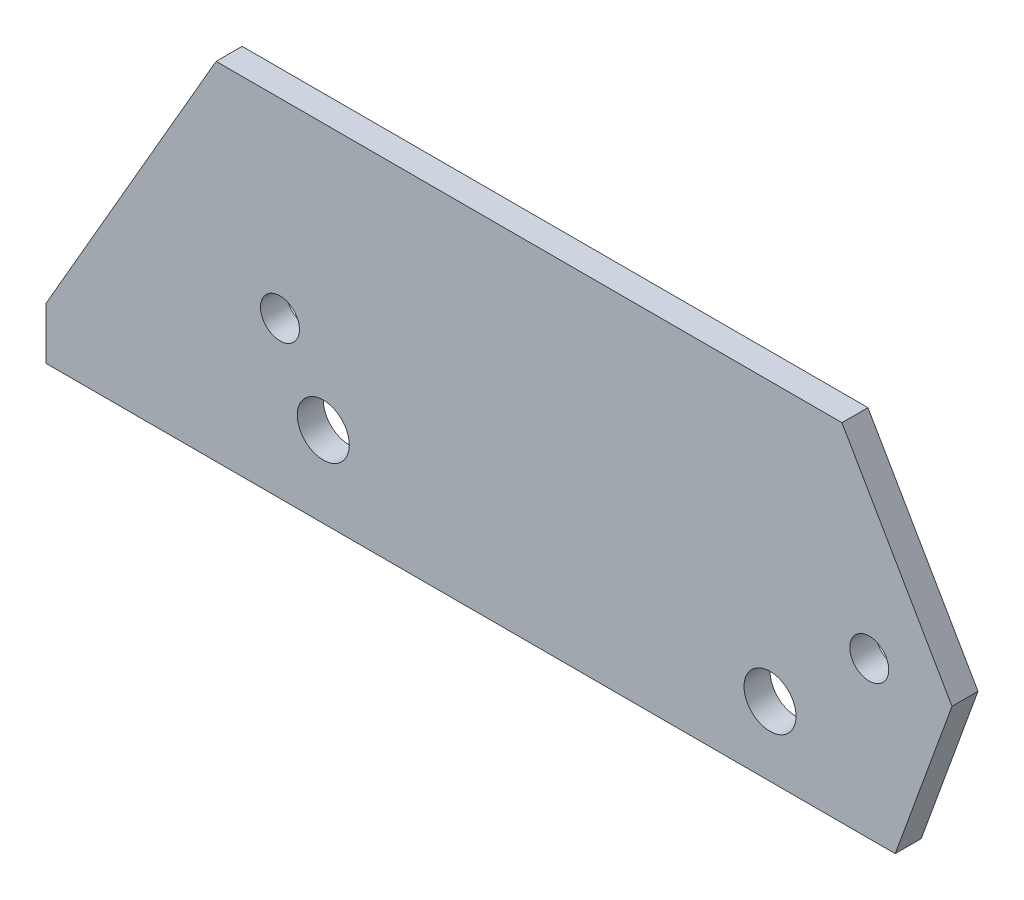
ISO-10303-21;
HEADER;
FILE_DESCRIPTION(('STEP AP214'),'2;1');
FILE_NAME('part.step','',(''),(''),'','','');
FILE_SCHEMA(('AUTOMOTIVE_DESIGN { 1 0 10303 214 1 1 1 1 }'));
ENDSEC;
DATA;
#1=APPLICATION_CONTEXT('core data for automotive mechanical design processes');
#2=APPLICATION_PROTOCOL_DEFINITION('international standard','automotive_design',2000,#1);
#3=PRODUCT_CONTEXT('',#1,'mechanical');
#4=PRODUCT('Part','Part','',(#3));
#5=PRODUCT_RELATED_PRODUCT_CATEGORY('part','',(#4));
#6=PRODUCT_DEFINITION_FORMATION('','',#4);
#7=PRODUCT_DEFINITION_CONTEXT('part definition',#1,'design');
#8=PRODUCT_DEFINITION('design','',#6,#7);
#9=PRODUCT_DEFINITION_SHAPE('','',#8);
#10=(LENGTH_UNIT() NAMED_UNIT(*) SI_UNIT(.MILLI.,.METRE.));
#11=(NAMED_UNIT(*) PLANE_ANGLE_UNIT() SI_UNIT($,.RADIAN.));
#12=(NAMED_UNIT(*) SI_UNIT($,.STERADIAN.) SOLID_ANGLE_UNIT());
#13=UNCERTAINTY_MEASURE_WITH_UNIT(LENGTH_MEASURE(1.E-05),#10,'distance_accuracy_value','');
#14=(GEOMETRIC_REPRESENTATION_CONTEXT(3) GLOBAL_UNCERTAINTY_ASSIGNED_CONTEXT((#13)) GLOBAL_UNIT_ASSIGNED_CONTEXT((#10,
#11,#12)) REPRESENTATION_CONTEXT('',''));
#15=CARTESIAN_POINT('',(0.,0.,0.));
#16=DIRECTION('',(0.,0.,1.));
#17=DIRECTION('',(1.,0.,0.));
#18=AXIS2_PLACEMENT_3D('',#15,#16,#17);
#19=CARTESIAN_POINT('',(0.,0.,3.));
#20=DIRECTION('',(0.,0.,-1.));
#21=DIRECTION('',(-1.,0.,0.));
#22=AXIS2_PLACEMENT_3D('',#19,#20,#21);
#23=PLANE('',#22);
#24=CARTESIAN_POINT('',(95.,18.,3.));
#25=DIRECTION('',(0.,0.,1.));
#26=DIRECTION('',(1.,0.,0.));
#27=AXIS2_PLACEMENT_3D('',#24,#25,#26);
#28=CIRCLE('',#27,2.25);
#29=CARTESIAN_POINT('',(97.25,18.,3.));
#30=VERTEX_POINT('',#29);
#31=EDGE_CURVE('E198',#30,#30,#28,.T.);
#32=ORIENTED_EDGE('',*,*,#31,.F.);
#33=EDGE_LOOP('',(#32));
#34=FACE_BOUND('',#33,.T.);
#35=CARTESIAN_POINT('',(27.,18.,3.));
#36=DIRECTION('',(0.,0.,1.));
#37=DIRECTION('',(1.,0.,0.));
#38=AXIS2_PLACEMENT_3D('',#35,#36,#37);
#39=CIRCLE('',#38,2.25);
#40=CARTESIAN_POINT('',(29.25,18.,3.));
#41=VERTEX_POINT('',#40);
#42=EDGE_CURVE('E130',#41,#41,#39,.T.);
#43=ORIENTED_EDGE('',*,*,#42,.F.);
#44=EDGE_LOOP('',(#43));
#45=FACE_BOUND('',#44,.T.);
#46=DIRECTION('',(1.,0.,0.));
#47=VECTOR('',#46,1.);
#48=CARTESIAN_POINT('',(98.,0.,3.));
#49=LINE('',#48,#47);
#50=CARTESIAN_POINT('',(0.,0.,3.));
#51=VERTEX_POINT('',#50);
#52=CARTESIAN_POINT('',(98.,0.,3.));
#53=VERTEX_POINT('',#52);
#54=EDGE_CURVE('E137',#51,#53,#49,.T.);
#55=ORIENTED_EDGE('',*,*,#54,.T.);
#56=DIRECTION('',(0.342020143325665,0.93969262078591,0.));
#57=VECTOR('',#56,1.);
#58=CARTESIAN_POINT('',(104.551464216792,18.,3.));
#59=LINE('',#58,#57);
#60=CARTESIAN_POINT('',(104.551464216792,18.,3.));
#61=VERTEX_POINT('',#60);
#62=EDGE_CURVE('E95',#53,#61,#59,.T.);
#63=ORIENTED_EDGE('',*,*,#62,.T.);
#64=DIRECTION('',(-0.499999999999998,0.86602540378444,0.));
#65=VECTOR('',#64,1.);
#66=CARTESIAN_POINT('',(91.8497582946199,40.,3.));
#67=LINE('',#66,#65);
#68=CARTESIAN_POINT('',(91.8497582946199,40.,3.));
#69=VERTEX_POINT('',#68);
#70=EDGE_CURVE('E108',#61,#69,#67,.T.);
#71=ORIENTED_EDGE('',*,*,#70,.T.);
#72=DIRECTION('',(-1.,0.,0.));
#73=VECTOR('',#72,1.);
#74=CARTESIAN_POINT('',(19.6299091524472,40.,3.));
#75=LINE('',#74,#73);
#76=CARTESIAN_POINT('',(19.6299091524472,40.,3.));
#77=VERTEX_POINT('',#76);
#78=EDGE_CURVE('E102',#69,#77,#75,.T.);
#79=ORIENTED_EDGE('',*,*,#78,.T.);
#80=DIRECTION('',(-0.499999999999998,-0.86602540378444,0.));
#81=VECTOR('',#80,1.);
#82=CARTESIAN_POINT('',(0.,6.,3.));
#83=LINE('',#82,#81);
#84=CARTESIAN_POINT('',(0.,6.,3.));
#85=VERTEX_POINT('',#84);
#86=EDGE_CURVE('E106',#77,#85,#83,.T.);
#87=ORIENTED_EDGE('',*,*,#86,.T.);
#88=DIRECTION('',(0.,-1.,0.));
#89=VECTOR('',#88,1.);
#90=CARTESIAN_POINT('',(0.,0.,3.));
#91=LINE('',#90,#89);
#92=EDGE_CURVE('E58',#85,#51,#91,.T.);
#93=ORIENTED_EDGE('',*,*,#92,.T.);
#94=EDGE_LOOP('',(#55,#63,#71,#79,#87,#93));
#95=FACE_BOUND('',#94,.T.);
#96=CARTESIAN_POINT('',(32.,9.33974596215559,3.));
#97=DIRECTION('',(0.,0.,1.));
#98=DIRECTION('',(1.,0.,0.));
#99=AXIS2_PLACEMENT_3D('',#96,#97,#98);
#100=CIRCLE('',#99,3.);
#101=CARTESIAN_POINT('',(35.,9.33974596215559,3.));
#102=VERTEX_POINT('',#101);
#103=EDGE_CURVE('E204',#102,#102,#100,.T.);
#104=ORIENTED_EDGE('',*,*,#103,.F.);
#105=EDGE_LOOP('',(#104));
#106=FACE_BOUND('',#105,.T.);
#107=CARTESIAN_POINT('',(83.5514642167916,8.,3.));
#108=DIRECTION('',(0.,0.,1.));
#109=DIRECTION('',(1.,0.,0.));
#110=AXIS2_PLACEMENT_3D('',#107,#108,#109);
#111=CIRCLE('',#110,3.00000000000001);
#112=CARTESIAN_POINT('',(86.5514642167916,8.,3.));
#113=VERTEX_POINT('',#112);
#114=EDGE_CURVE('E189',#113,#113,#111,.T.);
#115=ORIENTED_EDGE('',*,*,#114,.F.);
#116=EDGE_LOOP('',(#115));
#117=FACE_BOUND('',#116,.T.);
#118=ADVANCED_FACE('F41',(#34,#45,#95,#106,#117),#23,.F.);
#119=CARTESIAN_POINT('',(0.,0.,0.));
#120=DIRECTION('',(0.,0.,-1.));
#121=DIRECTION('',(-1.,0.,0.));
#122=AXIS2_PLACEMENT_3D('',#119,#120,#121);
#123=PLANE('',#122);
#124=CARTESIAN_POINT('',(95.,18.,0.));
#125=DIRECTION('',(0.,0.,1.));
#126=DIRECTION('',(1.,0.,0.));
#127=AXIS2_PLACEMENT_3D('',#124,#125,#126);
#128=CIRCLE('',#127,2.25);
#129=CARTESIAN_POINT('',(97.25,18.,0.));
#130=VERTEX_POINT('',#129);
#131=EDGE_CURVE('E195',#130,#130,#128,.T.);
#132=ORIENTED_EDGE('',*,*,#131,.T.);
#133=EDGE_LOOP('',(#132));
#134=FACE_BOUND('',#133,.T.);
#135=CARTESIAN_POINT('',(27.,18.,0.));
#136=DIRECTION('',(0.,0.,1.));
#137=DIRECTION('',(1.,0.,0.));
#138=AXIS2_PLACEMENT_3D('',#135,#136,#137);
#139=CIRCLE('',#138,2.25);
#140=CARTESIAN_POINT('',(29.25,18.,0.));
#141=VERTEX_POINT('',#140);
#142=EDGE_CURVE('E207',#141,#141,#139,.T.);
#143=ORIENTED_EDGE('',*,*,#142,.T.);
#144=EDGE_LOOP('',(#143));
#145=FACE_BOUND('',#144,.T.);
#146=DIRECTION('',(1.,0.,0.));
#147=VECTOR('',#146,1.);
#148=CARTESIAN_POINT('',(98.,0.,0.));
#149=LINE('',#148,#147);
#150=CARTESIAN_POINT('',(0.,0.,0.));
#151=VERTEX_POINT('',#150);
#152=CARTESIAN_POINT('',(98.,0.,0.));
#153=VERTEX_POINT('',#152);
#154=EDGE_CURVE('E126',#151,#153,#149,.T.);
#155=ORIENTED_EDGE('',*,*,#154,.F.);
#156=DIRECTION('',(0.,-1.,0.));
#157=VECTOR('',#156,1.);
#158=CARTESIAN_POINT('',(0.,0.,0.));
#159=LINE('',#158,#157);
#160=CARTESIAN_POINT('',(0.,6.,0.));
#161=VERTEX_POINT('',#160);
#162=EDGE_CURVE('E87',#161,#151,#159,.T.);
#163=ORIENTED_EDGE('',*,*,#162,.F.);
#164=DIRECTION('',(-0.499999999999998,-0.86602540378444,0.));
#165=VECTOR('',#164,1.);
#166=CARTESIAN_POINT('',(0.,6.,0.));
#167=LINE('',#166,#165);
#168=CARTESIAN_POINT('',(19.6299091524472,40.,0.));
#169=VERTEX_POINT('',#168);
#170=EDGE_CURVE('E81',#169,#161,#167,.T.);
#171=ORIENTED_EDGE('',*,*,#170,.F.);
#172=DIRECTION('',(-1.,0.,0.));
#173=VECTOR('',#172,1.);
#174=CARTESIAN_POINT('',(19.6299091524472,40.,0.));
#175=LINE('',#174,#173);
#176=CARTESIAN_POINT('',(91.8497582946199,40.,0.));
#177=VERTEX_POINT('',#176);
#178=EDGE_CURVE('E116',#177,#169,#175,.T.);
#179=ORIENTED_EDGE('',*,*,#178,.F.);
#180=DIRECTION('',(-0.499999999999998,0.86602540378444,0.));
#181=VECTOR('',#180,1.);
#182=CARTESIAN_POINT('',(91.8497582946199,40.,0.));
#183=LINE('',#182,#181);
#184=CARTESIAN_POINT('',(104.551464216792,18.,0.));
#185=VERTEX_POINT('',#184);
#186=EDGE_CURVE('E132',#185,#177,#183,.T.);
#187=ORIENTED_EDGE('',*,*,#186,.F.);
#188=DIRECTION('',(0.342020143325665,0.93969262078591,0.));
#189=VECTOR('',#188,1.);
#190=CARTESIAN_POINT('',(104.551464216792,18.,0.));
#191=LINE('',#190,#189);
#192=EDGE_CURVE('E129',#153,#185,#191,.T.);
#193=ORIENTED_EDGE('',*,*,#192,.F.);
#194=EDGE_LOOP('',(#155,#163,#171,#179,#187,#193));
#195=FACE_BOUND('',#194,.T.);
#196=CARTESIAN_POINT('',(32.,9.33974596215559,0.));
#197=DIRECTION('',(0.,0.,1.));
#198=DIRECTION('',(1.,0.,0.));
#199=AXIS2_PLACEMENT_3D('',#196,#197,#198);
#200=CIRCLE('',#199,3.);
#201=CARTESIAN_POINT('',(35.,9.33974596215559,0.));
#202=VERTEX_POINT('',#201);
#203=EDGE_CURVE('E201',#202,#202,#200,.T.);
#204=ORIENTED_EDGE('',*,*,#203,.T.);
#205=EDGE_LOOP('',(#204));
#206=FACE_BOUND('',#205,.T.);
#207=CARTESIAN_POINT('',(83.5514642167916,8.,0.));
#208=DIRECTION('',(0.,0.,1.));
#209=DIRECTION('',(1.,0.,0.));
#210=AXIS2_PLACEMENT_3D('',#207,#208,#209);
#211=CIRCLE('',#210,3.00000000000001);
#212=CARTESIAN_POINT('',(86.5514642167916,8.,0.));
#213=VERTEX_POINT('',#212);
#214=EDGE_CURVE('E192',#213,#213,#211,.T.);
#215=ORIENTED_EDGE('',*,*,#214,.T.);
#216=EDGE_LOOP('',(#215));
#217=FACE_BOUND('',#216,.T.);
#218=ADVANCED_FACE('F146',(#134,#145,#195,#206,#217),#123,.T.);
#219=CARTESIAN_POINT('',(98.,0.,3.));
#220=DIRECTION('',(0.,1.,0.));
#221=DIRECTION('',(-1.,0.,0.));
#222=AXIS2_PLACEMENT_3D('',#219,#220,#221);
#223=PLANE('',#222);
#224=ORIENTED_EDGE('',*,*,#154,.T.);
#225=DIRECTION('',(0.,0.,-1.));
#226=VECTOR('',#225,1.);
#227=CARTESIAN_POINT('',(98.,0.,3.));
#228=LINE('',#227,#226);
#229=EDGE_CURVE('E13',#53,#153,#228,.T.);
#230=ORIENTED_EDGE('',*,*,#229,.F.);
#231=ORIENTED_EDGE('',*,*,#54,.F.);
#232=DIRECTION('',(0.,0.,-1.));
#233=VECTOR('',#232,1.);
#234=CARTESIAN_POINT('',(0.,0.,3.));
#235=LINE('',#234,#233);
#236=EDGE_CURVE('E122',#51,#151,#235,.T.);
#237=ORIENTED_EDGE('',*,*,#236,.T.);
#238=EDGE_LOOP('',(#224,#230,#231,#237));
#239=FACE_BOUND('',#238,.T.);
#240=ADVANCED_FACE('F43',(#239),#223,.F.);
#241=CARTESIAN_POINT('',(104.551464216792,18.,3.));
#242=DIRECTION('',(-0.93969262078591,0.342020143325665,0.));
#243=DIRECTION('',(-0.342020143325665,-0.93969262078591,0.));
#244=AXIS2_PLACEMENT_3D('',#241,#242,#243);
#245=PLANE('',#244);
#246=ORIENTED_EDGE('',*,*,#192,.T.);
#247=DIRECTION('',(0.,0.,-1.));
#248=VECTOR('',#247,1.);
#249=CARTESIAN_POINT('',(104.551464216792,18.,3.));
#250=LINE('',#249,#248);
#251=EDGE_CURVE('E50',#61,#185,#250,.T.);
#252=ORIENTED_EDGE('',*,*,#251,.F.);
#253=ORIENTED_EDGE('',*,*,#62,.F.);
#254=ORIENTED_EDGE('',*,*,#229,.T.);
#255=EDGE_LOOP('',(#246,#252,#253,#254));
#256=FACE_BOUND('',#255,.T.);
#257=ADVANCED_FACE('F264',(#256),#245,.F.);
#258=CARTESIAN_POINT('',(91.8497582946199,40.,3.));
#259=DIRECTION('',(-0.86602540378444,-0.499999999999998,0.));
#260=DIRECTION('',(0.499999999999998,-0.86602540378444,0.));
#261=AXIS2_PLACEMENT_3D('',#258,#259,#260);
#262=PLANE('',#261);
#263=ORIENTED_EDGE('',*,*,#186,.T.);
#264=DIRECTION('',(0.,0.,-1.));
#265=VECTOR('',#264,1.);
#266=CARTESIAN_POINT('',(91.8497582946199,40.,3.));
#267=LINE('',#266,#265);
#268=EDGE_CURVE('E117',#69,#177,#267,.T.);
#269=ORIENTED_EDGE('',*,*,#268,.F.);
#270=ORIENTED_EDGE('',*,*,#70,.F.);
#271=ORIENTED_EDGE('',*,*,#251,.T.);
#272=EDGE_LOOP('',(#263,#269,#270,#271));
#273=FACE_BOUND('',#272,.T.);
#274=ADVANCED_FACE('F143',(#273),#262,.F.);
#275=CARTESIAN_POINT('',(19.6299091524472,40.,3.));
#276=DIRECTION('',(0.,-1.,0.));
#277=DIRECTION('',(0.,0.,-1.));
#278=AXIS2_PLACEMENT_3D('',#275,#276,#277);
#279=PLANE('',#278);
#280=ORIENTED_EDGE('',*,*,#178,.T.);
#281=DIRECTION('',(0.,0.,-1.));
#282=VECTOR('',#281,1.);
#283=CARTESIAN_POINT('',(19.6299091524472,40.,3.));
#284=LINE('',#283,#282);
#285=EDGE_CURVE('E113',#77,#169,#284,.T.);
#286=ORIENTED_EDGE('',*,*,#285,.F.);
#287=ORIENTED_EDGE('',*,*,#78,.F.);
#288=ORIENTED_EDGE('',*,*,#268,.T.);
#289=EDGE_LOOP('',(#280,#286,#287,#288));
#290=FACE_BOUND('',#289,.T.);
#291=ADVANCED_FACE('F114',(#290),#279,.F.);
#292=CARTESIAN_POINT('',(0.,6.,3.));
#293=DIRECTION('',(0.86602540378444,-0.499999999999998,0.));
#294=DIRECTION('',(0.499999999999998,0.86602540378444,0.));
#295=AXIS2_PLACEMENT_3D('',#292,#293,#294);
#296=PLANE('',#295);
#297=ORIENTED_EDGE('',*,*,#170,.T.);
#298=DIRECTION('',(0.,0.,-1.));
#299=VECTOR('',#298,1.);
#300=CARTESIAN_POINT('',(0.,6.,3.));
#301=LINE('',#300,#299);
#302=EDGE_CURVE('E118',#85,#161,#301,.T.);
#303=ORIENTED_EDGE('',*,*,#302,.F.);
#304=ORIENTED_EDGE('',*,*,#86,.F.);
#305=ORIENTED_EDGE('',*,*,#285,.T.);
#306=EDGE_LOOP('',(#297,#303,#304,#305));
#307=FACE_BOUND('',#306,.T.);
#308=ADVANCED_FACE('F120',(#307),#296,.F.);
#309=CARTESIAN_POINT('',(0.,0.,3.));
#310=DIRECTION('',(1.,0.,0.));
#311=DIRECTION('',(0.,0.,-1.));
#312=AXIS2_PLACEMENT_3D('',#309,#310,#311);
#313=PLANE('',#312);
#314=ORIENTED_EDGE('',*,*,#162,.T.);
#315=ORIENTED_EDGE('',*,*,#236,.F.);
#316=ORIENTED_EDGE('',*,*,#92,.F.);
#317=ORIENTED_EDGE('',*,*,#302,.T.);
#318=EDGE_LOOP('',(#314,#315,#316,#317));
#319=FACE_BOUND('',#318,.T.);
#320=ADVANCED_FACE('F151',(#319),#313,.F.);
#321=CARTESIAN_POINT('',(27.,18.,3.));
#322=DIRECTION('',(0.,0.,-1.));
#323=DIRECTION('',(-1.,0.,0.));
#324=AXIS2_PLACEMENT_3D('',#321,#322,#323);
#325=CYLINDRICAL_SURFACE('',#324,2.25);
#326=ORIENTED_EDGE('',*,*,#42,.T.);
#327=EDGE_LOOP('',(#326));
#328=FACE_BOUND('',#327,.T.);
#329=ORIENTED_EDGE('',*,*,#142,.F.);
#330=EDGE_LOOP('',(#329));
#331=FACE_BOUND('',#330,.T.);
#332=ADVANCED_FACE('F153',(#328,#331),#325,.F.);
#333=CARTESIAN_POINT('',(32.,9.33974596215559,3.));
#334=DIRECTION('',(0.,0.,-1.));
#335=DIRECTION('',(-1.,0.,0.));
#336=AXIS2_PLACEMENT_3D('',#333,#334,#335);
#337=CYLINDRICAL_SURFACE('',#336,3.);
#338=ORIENTED_EDGE('',*,*,#103,.T.);
#339=EDGE_LOOP('',(#338));
#340=FACE_BOUND('',#339,.T.);
#341=ORIENTED_EDGE('',*,*,#203,.F.);
#342=EDGE_LOOP('',(#341));
#343=FACE_BOUND('',#342,.T.);
#344=ADVANCED_FACE('F159',(#340,#343),#337,.F.);
#345=CARTESIAN_POINT('',(95.,18.,3.));
#346=DIRECTION('',(0.,0.,-1.));
#347=DIRECTION('',(-1.,0.,0.));
#348=AXIS2_PLACEMENT_3D('',#345,#346,#347);
#349=CYLINDRICAL_SURFACE('',#348,2.25);
#350=ORIENTED_EDGE('',*,*,#31,.T.);
#351=EDGE_LOOP('',(#350));
#352=FACE_BOUND('',#351,.T.);
#353=ORIENTED_EDGE('',*,*,#131,.F.);
#354=EDGE_LOOP('',(#353));
#355=FACE_BOUND('',#354,.T.);
#356=ADVANCED_FACE('F176',(#352,#355),#349,.F.);
#357=CARTESIAN_POINT('',(83.5514642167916,8.,3.));
#358=DIRECTION('',(0.,0.,-1.));
#359=DIRECTION('',(-1.,0.,0.));
#360=AXIS2_PLACEMENT_3D('',#357,#358,#359);
#361=CYLINDRICAL_SURFACE('',#360,3.00000000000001);
#362=ORIENTED_EDGE('',*,*,#114,.T.);
#363=EDGE_LOOP('',(#362));
#364=FACE_BOUND('',#363,.T.);
#365=ORIENTED_EDGE('',*,*,#214,.F.);
#366=EDGE_LOOP('',(#365));
#367=FACE_BOUND('',#366,.T.);
#368=ADVANCED_FACE('F180',(#364,#367),#361,.F.);
#369=CLOSED_SHELL('',(#118,#218,#240,#257,#274,#291,#308,#320,#332,#344,#356,#368));
#370=MANIFOLD_SOLID_BREP('B2',#369);
#371=ADVANCED_BREP_SHAPE_REPRESENTATION('',(#18,#370),#14);
#372=SHAPE_DEFINITION_REPRESENTATION(#9,#371);
ENDSEC;
END-ISO-10303-21;
